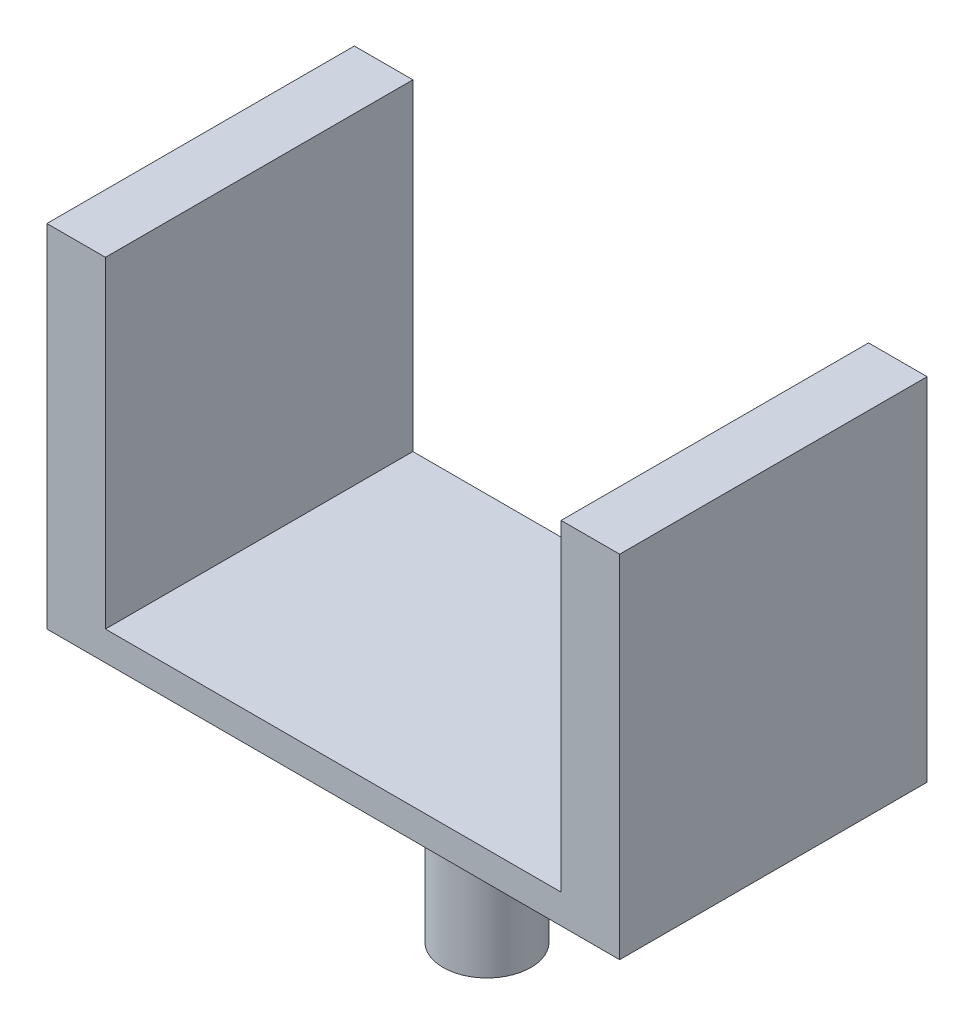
from build123d import *

# Parameters (mm, degrees)
SKETCH2_W               = 39.14
SKETCH2_H               = 21.01
BOSS_EXTRUDE1_DEPTH     = 24
CUT_EXTRUDE1_DEPTH      = 24
CUT_EXTRUDE1_DEPTH_BACK = 24
SKETCH3_OUTSIDE_W       = 51.238
SKETCH3_OUTSIDE_H       = 36.098
SKETCH4_R               = 3
BOSS_EXTRUDE2_DEPTH     = 14


with BuildPart() as part:
    # Sketch2 → Boss-Extrude1 (new body)
    with BuildSketch(Plane(origin=(0, 0, 0), x_dir=(1, 0, 0), z_dir=(0, 1, 0))):
        Rectangle(SKETCH2_W, SKETCH2_H)
    extrude(amount=BOSS_EXTRUDE1_DEPTH)

    # Sketch3 outside → Cut-Extrude1 (cut, two sides: drawn at the far end of the back side and taken through both)
    with BuildSketch(Plane.XY.offset(-CUT_EXTRUDE1_DEPTH_BACK)):
        with Locations((0, 12)):
            Rectangle(SKETCH3_OUTSIDE_W, SKETCH3_OUTSIDE_H)
        Polygon((-19.57, 24), (-19.57, 0), (19.57, 0), (19.57, 24), (15.57, 24), (15.57, 2), (-15.57, 2), (-15.57, 24), align=None, mode=Mode.SUBTRACT)
    extrude(amount=CUT_EXTRUDE1_DEPTH + CUT_EXTRUDE1_DEPTH_BACK, mode=Mode.SUBTRACT)

    # Sketch4 → Boss-Extrude2 (add)
    with BuildSketch(Plane(origin=(0, 0, 0), x_dir=(1, 0, 0), z_dir=(0, 1, 0))):
        with Locations(Location((0, 0, 0), (0, 0, 270))):
            Circle(SKETCH4_R)
    extrude(amount=-BOSS_EXTRUDE2_DEPTH)


solid = part.part
